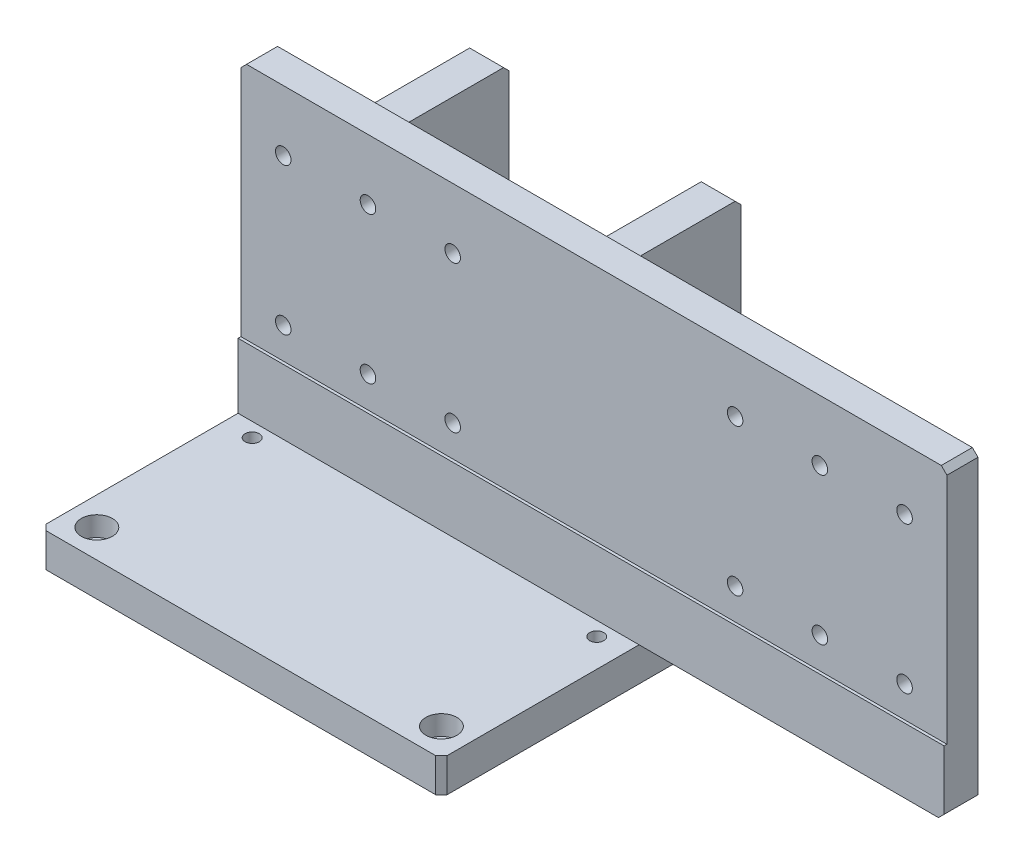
from build123d import *

# Parameters (mm, degrees)
SKETCH_1_W                  = 142
SKETCH_1_H                  = 130
EXTRUDE_1_DEPTH             = 12
SKETCH_2_W                  = 250
SKETCH_2_H                  = 12
EXTRUDE_2_DEPTH             = 107.5
SKETCH_3_W                  = 250
SKETCH_3_H                  = 84.5
CUT_EXTRUDE_1_DEPTH         = 1
SKETCH_4_W                  = 12
SKETCH_4_H                  = 48
EXTRUDE_3_DEPTH             = 95
EXTRUDE_3_2_DEPTH           = 95
CUT_EXTRUDE_2_DEPTH         = 190.550125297
HOLE_WIZARD_M6_1_AT_2_COUNT = 2
HOLE_WIZARD_M6_1_AT_2_PITCH = 122
HOLE_WIZARD_M6_1_AT_3_COUNT = 2
HOLE_WIZARD_M6_1_AT_3_PITCH = 110
HOLE_WIZARD_M6_1_AT_4_COUNT = 2
HOLE_WIZARD_M6_1_AT_4_PITCH = 164.268073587
SKETCH_9_W                  = 2.5
SKETCH_9_H                  = 12
F_5_0MM_1_AT_2_COUNT        = 2
F_5_0MM_1_AT_2_PITCH        = 122
HOLE_WIZARD_M5_1_AT_2_COUNT = 2
HOLE_WIZARD_M5_1_AT_2_PITCH = 30
HOLE_WIZARD_M5_1_AT_3_COUNT = 2
HOLE_WIZARD_M5_1_AT_3_PITCH = 60
HOLE_WIZARD_M5_1_AT_4_COUNT = 2
HOLE_WIZARD_M5_1_AT_4_PITCH = 52
HOLE_WIZARD_M5_1_AT_5_COUNT = 2
HOLE_WIZARD_M5_1_AT_5_PITCH = 60.033324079
HOLE_WIZARD_M5_1_AT_6_COUNT = 2
HOLE_WIZARD_M5_1_AT_6_PITCH = 79.397732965
PATTERN_LINEAR_1_COUNT      = 2
PATTERN_LINEAR_1_PITCH      = 160
CHAMFER_1_SIZE              = 2
CHAMFER_2_SIZE              = 2
HOLE_WIZARD_M4_1_AT_2_COUNT = 2
HOLE_WIZARD_M4_1_AT_2_PITCH = 28


with BuildPart() as part:
    # Sketch 1 → Extrude 1 (new body)
    with BuildSketch(Plane(origin=(0, 0, 0), x_dir=(1, 0, 0), z_dir=(0, 1, 0))):
        Rectangle(SKETCH_1_W, SKETCH_1_H)
    extrude(amount=EXTRUDE_1_DEPTH)

    # Sketch 7 → Hole Wizard M6 _ _ _ _ _1 (revolve, cut)
    with BuildSketch(Plane(origin=(-61, 12, -55), x_dir=(0, 0, 1), z_dir=(1, 0, 0))):
        Polygon((0, 0), (0, 12), (3.3, 12), (3.3, 7), (5.5, 7), (5.5, 0), align=None)
    hole_wizard_m6_1 = revolve(axis=Axis((-61, 18.35, -55), (0, -1, 0)), mode=Mode.SUBTRACT)

    # Hole Wizard M6 _ _ _ _ _1 at 2: Hole Wizard M6 _ _ _ _ _1 ×2
    with Locations(*[(i * HOLE_WIZARD_M6_1_AT_2_PITCH, 0, 0) for i in range(1, HOLE_WIZARD_M6_1_AT_2_COUNT)]):
        add(hole_wizard_m6_1, mode=Mode.SUBTRACT)

    # Hole Wizard M6 _ _ _ _ _1 at 3: Hole Wizard M6 _ _ _ _ _1 ×2
    with Locations(*[(0, 0, i * HOLE_WIZARD_M6_1_AT_3_PITCH) for i in range(1, HOLE_WIZARD_M6_1_AT_3_COUNT)]):
        add(hole_wizard_m6_1, mode=Mode.SUBTRACT)

    # Hole Wizard M6 _ _ _ _ _1 at 4: Hole Wizard M6 _ _ _ _ _1 ×2
    with Locations(*[Vector(0.742688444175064, 0, 0.6696371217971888) * (i * HOLE_WIZARD_M6_1_AT_4_PITCH) for i in range(1, HOLE_WIZARD_M6_1_AT_4_COUNT)]):
        add(hole_wizard_m6_1, mode=Mode.SUBTRACT)

    # Sketch 9 → 5.0mm _ _1 (revolve, cut)
    with BuildSketch(Plane(origin=(-61, 12, 0), x_dir=(0, 0, 1), z_dir=(1, 0, 0))):
        with Locations((1.25, 6)):
            Rectangle(SKETCH_9_W, SKETCH_9_H)
    f_5_0mm_1 = revolve(axis=Axis((-61, 18.35, 0), (0, -1, 0)), mode=Mode.SUBTRACT)

    # 5.0mm _ _1 at 2: 5.0mm _ _1 ×2
    with Locations(*[(i * F_5_0MM_1_AT_2_PITCH, 0, 0) for i in range(1, F_5_0MM_1_AT_2_COUNT)]):
        add(f_5_0mm_1, mode=Mode.SUBTRACT)

    # Chamfer 2
    chamfer_2_edges = [part.edges().sort_by_distance(p)[0] for p in [
        (71, 6, 65),
        (-71, 6, 65),
        (-71, 6, -65),
        (71, 6, -65),
    ]]
    chamfer(chamfer_2_edges, length=CHAMFER_2_SIZE)

    # Sketch 13 → Hole Wizard M4 _ _1 (revolve, cut)
    with BuildSketch(Plane(origin=(-71, 6, -51), x_dir=(0, 0, 1), z_dir=(0, 1, 0))):
        Polygon((0, 0), (0, 4.991420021), (1.65, 4), (1.65, 0.375), (2.025, 0), align=None)
    hole_wizard_m4_1 = revolve(axis=Axis((-77.35, 6, -51), (1, 0, 0)), mode=Mode.SUBTRACT)

    # Hole Wizard M4 _ _1 at 2: Hole Wizard M4 _ _1 ×2
    with Locations(*[(0, 0, i * HOLE_WIZARD_M4_1_AT_2_PITCH) for i in range(1, HOLE_WIZARD_M4_1_AT_2_COUNT)]):
        add(hole_wizard_m4_1, mode=Mode.SUBTRACT)


with BuildPart() as body_2:
    # Sketch 2 → Extrude 2 (new body)
    with BuildSketch(Plane(origin=(0, 12, 0), x_dir=(1, 0, 0), z_dir=(0, 1, 0))):
        with Locations((54, 11)):
            Rectangle(SKETCH_2_W, SKETCH_2_H)
    extrude(amount=EXTRUDE_2_DEPTH)

    # Sketch 3 → Cut-Extrude 1 (cut)
    with BuildSketch(Plane.XY.offset(-5)):
        with Locations((54, 77.25)):
            Rectangle(SKETCH_3_W, SKETCH_3_H)
    extrude(amount=-CUT_EXTRUDE_1_DEPTH, mode=Mode.SUBTRACT)

    # Sketch 11 → Hole Wizard M5 _ _ _ _ _1 (revolve, cut)
    with BuildSketch(Plane(origin=(4, 98, -17), x_dir=(0, 1, 0), z_dir=(1, 0, 0))):
        Polygon((0, 0), (0, 82), (2.75, 82), (2.75, 6), (4.75, 6), (4.75, 0), align=None)
    hole_wizard_m5_1 = revolve(axis=Axis((4, 98, -23.35), (0, 0, 1)), mode=Mode.SUBTRACT)

    # Hole Wizard M5 _ _ _ _ _1 at 2: Hole Wizard M5 _ _ _ _ _1 ×2
    with Locations(*[(-i * HOLE_WIZARD_M5_1_AT_2_PITCH, 0, 0) for i in range(1, HOLE_WIZARD_M5_1_AT_2_COUNT)]):
        add(hole_wizard_m5_1, mode=Mode.SUBTRACT)

    # Hole Wizard M5 _ _ _ _ _1 at 3: Hole Wizard M5 _ _ _ _ _1 ×2
    with Locations(*[(-i * HOLE_WIZARD_M5_1_AT_3_PITCH, 0, 0) for i in range(1, HOLE_WIZARD_M5_1_AT_3_COUNT)]):
        add(hole_wizard_m5_1, mode=Mode.SUBTRACT)

    # Hole Wizard M5 _ _ _ _ _1 at 4: Hole Wizard M5 _ _ _ _ _1 ×2
    with Locations(*[(0, -i * HOLE_WIZARD_M5_1_AT_4_PITCH, 0) for i in range(1, HOLE_WIZARD_M5_1_AT_4_COUNT)]):
        add(hole_wizard_m5_1, mode=Mode.SUBTRACT)

    # Hole Wizard M5 _ _ _ _ _1 at 5: Hole Wizard M5 _ _ _ _ _1 ×2
    with Locations(*[Vector(-0.4997224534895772, -0.8661855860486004, 0) * (i * HOLE_WIZARD_M5_1_AT_5_PITCH) for i in range(1, HOLE_WIZARD_M5_1_AT_5_COUNT)]):
        add(hole_wizard_m5_1, mode=Mode.SUBTRACT)

    # Hole Wizard M5 _ _ _ _ _1 at 6: Hole Wizard M5 _ _ _ _ _1 ×2
    with Locations(*[Vector(-0.7556890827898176, -0.6549305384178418, 0) * (i * HOLE_WIZARD_M5_1_AT_6_PITCH) for i in range(1, HOLE_WIZARD_M5_1_AT_6_COUNT)]):
        add(hole_wizard_m5_1, mode=Mode.SUBTRACT)

    # Pattern Linear 1: Hole Wizard M5 _ _ _ _ _1 ×2
    with Locations(*[(i * PATTERN_LINEAR_1_PITCH, 0, 0) for i in range(1, PATTERN_LINEAR_1_COUNT)]):
        add(hole_wizard_m5_1, mode=Mode.SUBTRACT)

    # Pattern Linear 1 copy 1 sketch → Pattern Linear 1 copy 1 (revolve, cut)
    with BuildSketch(Plane(origin=(134, 98, -17), x_dir=(0, 1, 0), z_dir=(1, 0, 0))):
        Polygon((0, 0), (0, 82), (2.75, 82), (2.75, 6), (4.75, 6), (4.75, 0), align=None)
    revolve(axis=Axis((134, 98, -23.35), (0, 0, 1)), mode=Mode.SUBTRACT)

    # Pattern Linear 1 copy 2 sketch → Pattern Linear 1 copy 2 (revolve, cut)
    with BuildSketch(Plane(origin=(104, 98, -17), x_dir=(0, 1, 0), z_dir=(1, 0, 0))):
        Polygon((0, 0), (0, 82), (2.75, 82), (2.75, 6), (4.75, 6), (4.75, 0), align=None)
    revolve(axis=Axis((104, 98, -23.35), (0, 0, 1)), mode=Mode.SUBTRACT)

    # Pattern Linear 1 copy 3 sketch → Pattern Linear 1 copy 3 (revolve, cut)
    with BuildSketch(Plane(origin=(164, 46, -17), x_dir=(0, 1, 0), z_dir=(1, 0, 0))):
        Polygon((0, 0), (0, 82), (2.75, 82), (2.75, 6), (4.75, 6), (4.75, 0), align=None)
    revolve(axis=Axis((164, 46, -23.35), (0, 0, 1)), mode=Mode.SUBTRACT)

    # Pattern Linear 1 copy 4 sketch → Pattern Linear 1 copy 4 (revolve, cut)
    with BuildSketch(Plane(origin=(134, 46, -17), x_dir=(0, 1, 0), z_dir=(1, 0, 0))):
        Polygon((0, 0), (0, 82), (2.75, 82), (2.75, 6), (4.75, 6), (4.75, 0), align=None)
    revolve(axis=Axis((134, 46, -23.35), (0, 0, 1)), mode=Mode.SUBTRACT)

    # Pattern Linear 1 copy 5 sketch → Pattern Linear 1 copy 5 (revolve, cut)
    with BuildSketch(Plane(origin=(104, 46, -17), x_dir=(0, 1, 0), z_dir=(1, 0, 0))):
        Polygon((0, 0), (0, 82), (2.75, 82), (2.75, 6), (4.75, 6), (4.75, 0), align=None)
    revolve(axis=Axis((104, 46, -23.35), (0, 0, 1)), mode=Mode.SUBTRACT)

    # Chamfer 1
    chamfer_1_edges = [body_2.edges().sort_by_distance(p)[0] for p in [
        (179, 119.5, -11.5),
        (-71, 119.5, -11.5),
        (179, 12, -11),
    ]]
    chamfer(chamfer_1_edges, length=CHAMFER_1_SIZE)


with BuildPart() as body_3:
    # Sketch 4 → Extrude 3 (new body)
    with BuildSketch(Plane(origin=(0, 12, 0), x_dir=(1, 0, 0), z_dir=(0, 1, 0))):
        with Locations((-41, 41)):
            Rectangle(SKETCH_4_W, SKETCH_4_H)
    extrude(amount=EXTRUDE_3_DEPTH)


with BuildPart() as body_4:
    # Sketch 4 → Extrude 3 2 (new body)
    with BuildSketch(Plane(origin=(0, 12, 0), x_dir=(1, 0, 0), z_dir=(0, 1, 0))):
        with Locations((41, 41)):
            Rectangle(SKETCH_4_W, SKETCH_4_H)
    extrude(amount=EXTRUDE_3_2_DEPTH)


with BuildPart() as cut_extrude_2_tool:
    # Sketch 5 → Cut-Extrude 2 (new, through all)
    with BuildSketch(Plane(origin=(47, 0, 0), x_dir=(0, 0, -1), z_dir=(1, 0, 0))):
        Polygon((65, 107), (65, 105), (63, 107), align=None)
    extrude(amount=-CUT_EXTRUDE_2_DEPTH)


with BuildPart() as body_3_1:
    add(body_3.part)

    # Cut-Extrude 2: cut by cut_extrude_2_tool
    add(cut_extrude_2_tool.part, mode=Mode.SUBTRACT)


with BuildPart() as body_4_1:
    add(body_4.part)

    # Cut-Extrude 2: cut by cut_extrude_2_tool
    add(cut_extrude_2_tool.part, mode=Mode.SUBTRACT)


solid = Compound([part.part, body_2.part, body_3_1.part, body_4_1.part])
